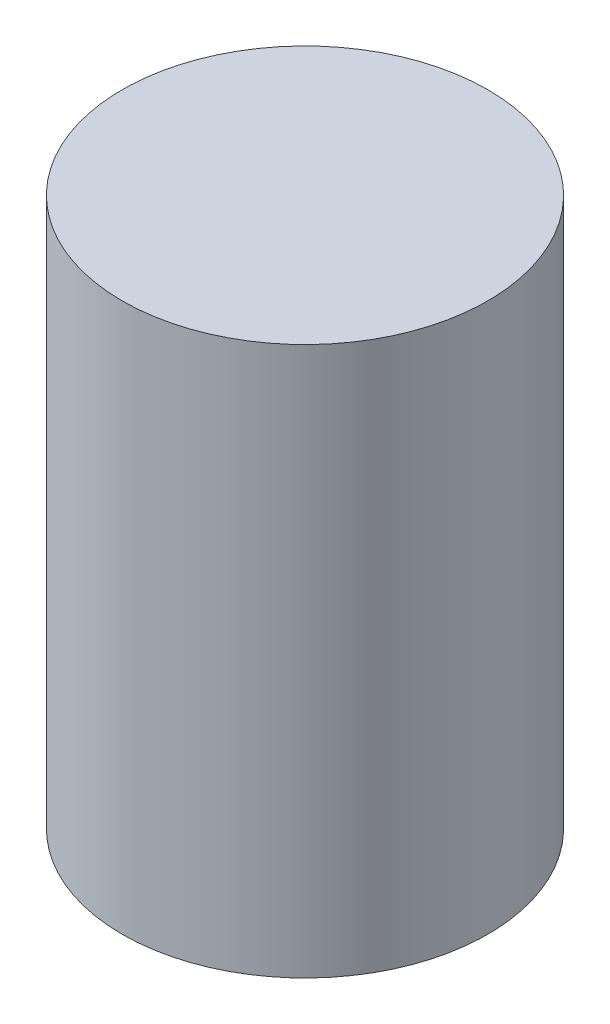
ISO-10303-21;
HEADER;
FILE_DESCRIPTION(('STEP AP214'),'2;1');
FILE_NAME('part.step','',(''),(''),'','','');
FILE_SCHEMA(('AUTOMOTIVE_DESIGN { 1 0 10303 214 1 1 1 1 }'));
ENDSEC;
DATA;
#1=APPLICATION_CONTEXT('core data for automotive mechanical design processes');
#2=APPLICATION_PROTOCOL_DEFINITION('international standard','automotive_design',2000,#1);
#3=PRODUCT_CONTEXT('',#1,'mechanical');
#4=PRODUCT('Part','Part','',(#3));
#5=PRODUCT_RELATED_PRODUCT_CATEGORY('part','',(#4));
#6=PRODUCT_DEFINITION_FORMATION('','',#4);
#7=PRODUCT_DEFINITION_CONTEXT('part definition',#1,'design');
#8=PRODUCT_DEFINITION('design','',#6,#7);
#9=PRODUCT_DEFINITION_SHAPE('','',#8);
#10=(LENGTH_UNIT() NAMED_UNIT(*) SI_UNIT(.MILLI.,.METRE.));
#11=(NAMED_UNIT(*) PLANE_ANGLE_UNIT() SI_UNIT($,.RADIAN.));
#12=(NAMED_UNIT(*) SI_UNIT($,.STERADIAN.) SOLID_ANGLE_UNIT());
#13=UNCERTAINTY_MEASURE_WITH_UNIT(LENGTH_MEASURE(1.E-05),#10,'distance_accuracy_value','');
#14=(GEOMETRIC_REPRESENTATION_CONTEXT(3) GLOBAL_UNCERTAINTY_ASSIGNED_CONTEXT((#13)) GLOBAL_UNIT_ASSIGNED_CONTEXT((#10,
#11,#12)) REPRESENTATION_CONTEXT('',''));
#15=CARTESIAN_POINT('',(0.,0.,0.));
#16=DIRECTION('',(0.,0.,1.));
#17=DIRECTION('',(1.,0.,0.));
#18=AXIS2_PLACEMENT_3D('',#15,#16,#17);
#19=CARTESIAN_POINT('',(0.,19.05,0.));
#20=DIRECTION('',(0.,-1.,0.));
#21=DIRECTION('',(0.,0.,-1.));
#22=AXIS2_PLACEMENT_3D('',#19,#20,#21);
#23=CYLINDRICAL_SURFACE('',#22,6.35);
#24=CARTESIAN_POINT('',(0.,5.08,-6.35));
#25=CARTESIAN_POINT('',(-0.0705826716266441,5.0799974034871,-6.34999869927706));
#26=CARTESIAN_POINT('',(-0.141198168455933,5.07409596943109,-6.34881109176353));
#27=CARTESIAN_POINT('',(-0.280433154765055,5.05066490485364,-6.34418804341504));
#28=CARTESIAN_POINT('',(-0.349051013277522,5.03312603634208,-6.34075081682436));
#29=CARTESIAN_POINT('',(-0.482257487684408,4.9869835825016,-6.33201234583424));
#30=CARTESIAN_POINT('',(-0.54684989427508,4.95839059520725,-6.32671288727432));
#31=CARTESIAN_POINT('',(-0.670316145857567,4.89098304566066,-6.31482605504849));
#32=CARTESIAN_POINT('',(-0.729190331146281,4.85216909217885,-6.30823875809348));
#33=CARTESIAN_POINT('',(-0.840350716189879,4.76486411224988,-6.29440149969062));
#34=CARTESIAN_POINT('',(-0.892548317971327,4.71626138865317,-6.28714446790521));
#35=CARTESIAN_POINT('',(-0.988106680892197,4.61099863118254,-6.27283709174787));
#36=CARTESIAN_POINT('',(-1.03146675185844,4.5543379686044,-6.26578676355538));
#37=CARTESIAN_POINT('',(-1.10849632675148,4.43393043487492,-6.25262201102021));
#38=CARTESIAN_POINT('',(-1.14207409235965,4.37012379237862,-6.24651668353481));
#39=CARTESIAN_POINT('',(-1.19799819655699,4.23763208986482,-6.23603360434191));
#40=CARTESIAN_POINT('',(-1.22034564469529,4.16894751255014,-6.23165568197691));
#41=CARTESIAN_POINT('',(-1.25288713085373,4.02960285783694,-6.225194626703));
#42=CARTESIAN_POINT('',(-1.26323661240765,3.95898046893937,-6.22308217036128));
#43=CARTESIAN_POINT('',(-1.27197120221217,3.81697252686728,-6.22130296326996));
#44=CARTESIAN_POINT('',(-1.27035753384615,3.74558705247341,-6.22163596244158));
#45=CARTESIAN_POINT('',(-1.25533730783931,3.60521657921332,-6.22468339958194));
#46=CARTESIAN_POINT('',(-1.24210894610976,3.53621161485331,-6.2273618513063));
#47=CARTESIAN_POINT('',(-1.20451611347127,3.40142058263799,-6.23474173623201));
#48=CARTESIAN_POINT('',(-1.18015111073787,3.33563466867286,-6.23944326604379));
#49=CARTESIAN_POINT('',(-1.12080647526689,3.20863561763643,-6.25037635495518));
#50=CARTESIAN_POINT('',(-1.08575621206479,3.14745639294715,-6.25661804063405));
#51=CARTESIAN_POINT('',(-1.0060858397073,3.03178102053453,-6.26992165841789));
#52=CARTESIAN_POINT('',(-0.961464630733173,2.97728564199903,-6.27698368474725));
#53=CARTESIAN_POINT('',(-0.862964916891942,2.87549665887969,-6.29128816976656));
#54=CARTESIAN_POINT('',(-0.808934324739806,2.8283502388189,-6.29853158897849));
#55=CARTESIAN_POINT('',(-0.693654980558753,2.74376661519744,-6.31226637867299));
#56=CARTESIAN_POINT('',(-0.632406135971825,2.70632953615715,-6.31875773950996));
#57=CARTESIAN_POINT('',(-0.50426542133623,2.64220006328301,-6.33027296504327));
#58=CARTESIAN_POINT('',(-0.437364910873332,2.61552449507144,-6.33529452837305));
#59=CARTESIAN_POINT('',(-0.299909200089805,2.57383219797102,-6.3432868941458));
#60=CARTESIAN_POINT('',(-0.229354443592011,2.55881405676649,-6.34625794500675));
#61=CARTESIAN_POINT('',(-0.0878578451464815,2.54107130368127,-6.34977993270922));
#62=CARTESIAN_POINT('',(-0.0169422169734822,2.53814526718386,-6.35037051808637));
#63=CARTESIAN_POINT('',(0.124364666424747,2.54412732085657,-6.3491751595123));
#64=CARTESIAN_POINT('',(0.194755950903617,2.55303474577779,-6.34738934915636));
#65=CARTESIAN_POINT('',(0.332366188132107,2.58226353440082,-6.34166666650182));
#66=CARTESIAN_POINT('',(0.399607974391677,2.60248154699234,-6.33774928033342));
#67=CARTESIAN_POINT('',(0.529747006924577,2.65364465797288,-6.32820111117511));
#68=CARTESIAN_POINT('',(0.592643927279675,2.68459056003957,-6.32257019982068));
#69=CARTESIAN_POINT('',(0.713157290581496,2.75676676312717,-6.31012087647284));
#70=CARTESIAN_POINT('',(0.770699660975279,2.79811833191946,-6.30328877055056));
#71=CARTESIAN_POINT('',(0.878100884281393,2.88976967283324,-6.28922713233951));
#72=CARTESIAN_POINT('',(0.927958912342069,2.94007040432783,-6.28199755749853));
#73=CARTESIAN_POINT('',(1.0193535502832,3.04910915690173,-6.26782215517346));
#74=CARTESIAN_POINT('',(1.06075188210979,3.1079639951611,-6.26088232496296));
#75=CARTESIAN_POINT('',(1.13307548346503,3.23191042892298,-6.24819923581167));
#76=CARTESIAN_POINT('',(1.16400117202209,3.29700177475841,-6.24245592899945));
#77=CARTESIAN_POINT('',(1.21431283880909,3.43124567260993,-6.23286460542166));
#78=CARTESIAN_POINT('',(1.23375864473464,3.5003750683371,-6.22900678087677));
#79=CARTESIAN_POINT('',(1.26073998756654,3.64100548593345,-6.22360244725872));
#80=CARTESIAN_POINT('',(1.26827707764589,3.71250619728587,-6.22205563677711));
#81=CARTESIAN_POINT('',(1.27116955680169,3.85446125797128,-6.22146520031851));
#82=CARTESIAN_POINT('',(1.26674345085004,3.9249110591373,-6.22237667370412));
#83=CARTESIAN_POINT('',(1.24631742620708,4.06404019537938,-6.22649978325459));
#84=CARTESIAN_POINT('',(1.23031760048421,4.1327195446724,-6.22971140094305));
#85=CARTESIAN_POINT('',(1.18729578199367,4.26621919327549,-6.23805285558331));
#86=CARTESIAN_POINT('',(1.16030058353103,4.33104843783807,-6.24317802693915));
#87=CARTESIAN_POINT('',(1.09607939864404,4.45529172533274,-6.25477178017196));
#88=CARTESIAN_POINT('',(1.0588525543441,4.51470531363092,-6.26124047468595));
#89=CARTESIAN_POINT('',(0.974478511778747,4.6275187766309,-6.27492979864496));
#90=CARTESIAN_POINT('',(0.92717351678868,4.68079933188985,-6.28216133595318));
#91=CARTESIAN_POINT('',(0.824311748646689,4.77873848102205,-6.29648323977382));
#92=CARTESIAN_POINT('',(0.768753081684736,4.82339509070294,-6.30357357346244));
#93=CARTESIAN_POINT('',(0.650262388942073,4.90325999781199,-6.31690167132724));
#94=CARTESIAN_POINT('',(0.58725928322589,4.93836452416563,-6.32312973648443));
#95=CARTESIAN_POINT('',(0.45614127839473,4.99743237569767,-6.3339360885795));
#96=CARTESIAN_POINT('',(0.38803105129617,5.02140574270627,-6.33851586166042));
#97=CARTESIAN_POINT('',(0.2664732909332,5.05288797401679,-6.34461993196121));
#98=CARTESIAN_POINT('',(0.213717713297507,5.06303685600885,-6.34662565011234));
#99=CARTESIAN_POINT('',(0.107314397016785,5.07659374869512,-6.34931615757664));
#100=CARTESIAN_POINT('',(0.0536666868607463,5.0800019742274,-6.35000098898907));
#101=CARTESIAN_POINT('',(0.,5.08,-6.35));
#102=B_SPLINE_CURVE_WITH_KNOTS('',3,(#24,#25,#26,#27,#28,#29,#30,#31,#32,#33,#34,#35,#36,#37,
#38,#39,#40,#41,#42,#43,#44,#45,#46,#47,#48,#49,#50,#51,#52,#53,#54,#55,#56,#57,#58,#59,#60,#61,
#62,#63,#64,#65,#66,#67,#68,#69,#70,#71,#72,#73,#74,#75,#76,#77,#78,#79,#80,#81,#82,#83,#84,#85,
#86,#87,#88,#89,#90,#91,#92,#93,#94,#95,#96,#97,#98,#99,#100,#101),.UNSPECIFIED.,.T.,.F.,(4,2,2,
2,2,2,2,2,2,2,2,2,2,2,2,2,2,2,2,2,2,2,2,2,2,2,2,2,2,2,2,2,2,2,2,2,2,2,4),(0.,0.211551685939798,
0.42327150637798,0.634788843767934,0.846293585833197,1.06036449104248,1.27445210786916,
1.49048717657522,1.70650089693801,1.91968355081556,2.13284440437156,2.34279093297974,
2.55274748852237,2.76412312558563,2.97552306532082,3.19072580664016,3.40593130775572,
3.62147199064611,3.83698655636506,4.04889634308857,4.26079421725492,4.47078676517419,
4.68079504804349,4.89337433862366,5.10597643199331,5.32181598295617,5.53764689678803,
5.75234283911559,5.96701077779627,6.17778447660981,6.38855648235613,6.5988179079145,
6.80909696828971,7.02294856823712,7.23684931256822,7.4529886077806,7.66893253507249,
7.82978844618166,7.99063923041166),.UNSPECIFIED.);
#103=CARTESIAN_POINT('',(0.,5.08,-6.35));
#104=VERTEX_POINT('',#103);
#105=EDGE_CURVE('E54',#104,#104,#102,.T.);
#106=ORIENTED_EDGE('',*,*,#105,.T.);
#107=EDGE_LOOP('',(#106));
#108=FACE_BOUND('',#107,.T.);
#109=CARTESIAN_POINT('',(0.,19.05,0.));
#110=DIRECTION('',(0.,1.,0.));
#111=DIRECTION('',(0.,0.,1.));
#112=AXIS2_PLACEMENT_3D('',#109,#110,#111);
#113=CIRCLE('',#112,6.35);
#114=CARTESIAN_POINT('',(0.,19.05,6.35));
#115=VERTEX_POINT('',#114);
#116=EDGE_CURVE('E10',#115,#115,#113,.T.);
#117=ORIENTED_EDGE('',*,*,#116,.F.);
#118=EDGE_LOOP('',(#117));
#119=FACE_BOUND('',#118,.T.);
#120=CARTESIAN_POINT('',(0.,0.,0.));
#121=DIRECTION('',(0.,1.,0.));
#122=DIRECTION('',(0.,0.,1.));
#123=AXIS2_PLACEMENT_3D('',#120,#121,#122);
#124=CIRCLE('',#123,6.35);
#125=CARTESIAN_POINT('',(0.,0.,6.35));
#126=VERTEX_POINT('',#125);
#127=EDGE_CURVE('E44',#126,#126,#124,.T.);
#128=ORIENTED_EDGE('',*,*,#127,.T.);
#129=EDGE_LOOP('',(#128));
#130=FACE_BOUND('',#129,.T.);
#131=ADVANCED_FACE('F31',(#108,#119,#130),#23,.T.);
#132=CARTESIAN_POINT('',(0.,19.05,0.));
#133=DIRECTION('',(0.,1.,0.));
#134=DIRECTION('',(0.,0.,1.));
#135=AXIS2_PLACEMENT_3D('',#132,#133,#134);
#136=PLANE('',#135);
#137=ORIENTED_EDGE('',*,*,#116,.T.);
#138=EDGE_LOOP('',(#137));
#139=FACE_BOUND('',#138,.T.);
#140=ADVANCED_FACE('F76',(#139),#136,.T.);
#141=CARTESIAN_POINT('',(0.,0.,0.));
#142=DIRECTION('',(0.,1.,0.));
#143=DIRECTION('',(0.,0.,1.));
#144=AXIS2_PLACEMENT_3D('',#141,#142,#143);
#145=PLANE('',#144);
#146=CARTESIAN_POINT('',(0.,0.,0.));
#147=DIRECTION('',(0.,-1.,0.));
#148=DIRECTION('',(0.,0.,-1.));
#149=AXIS2_PLACEMENT_3D('',#146,#147,#148);
#150=CIRCLE('',#149,3.175);
#151=CARTESIAN_POINT('',(0.,0.,-3.175));
#152=VERTEX_POINT('',#151);
#153=EDGE_CURVE('E51',#152,#152,#150,.T.);
#154=ORIENTED_EDGE('',*,*,#153,.F.);
#155=EDGE_LOOP('',(#154));
#156=FACE_BOUND('',#155,.T.);
#157=ORIENTED_EDGE('',*,*,#127,.F.);
#158=EDGE_LOOP('',(#157));
#159=FACE_BOUND('',#158,.T.);
#160=ADVANCED_FACE('F74',(#156,#159),#145,.F.);
#161=CARTESIAN_POINT('',(0.,15.875,0.));
#162=DIRECTION('',(0.,-1.,0.));
#163=DIRECTION('',(0.,0.,-1.));
#164=AXIS2_PLACEMENT_3D('',#161,#162,#163);
#165=CYLINDRICAL_SURFACE('',#164,3.175);
#166=CARTESIAN_POINT('',(0.,5.08,-3.175));
#167=CARTESIAN_POINT('',(0.068258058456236,5.07999374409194,-3.17499537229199));
#168=CARTESIAN_POINT('',(0.136634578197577,5.07446422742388,-3.17277301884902));
#169=CARTESIAN_POINT('',(0.271460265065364,5.05253770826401,-3.16409992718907));
#170=CARTESIAN_POINT('',(0.337903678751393,5.0361111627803,-3.15763769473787));
#171=CARTESIAN_POINT('',(0.466695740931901,4.99308369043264,-3.1411812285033));
#172=CARTESIAN_POINT('',(0.529057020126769,4.96651607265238,-3.13119856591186));
#173=CARTESIAN_POINT('',(0.648380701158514,4.90409282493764,-3.1086844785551));
#174=CARTESIAN_POINT('',(0.705344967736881,4.86824041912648,-3.09615393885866));
#175=CARTESIAN_POINT('',(0.815023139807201,4.7864804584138,-3.06915112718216));
#176=CARTESIAN_POINT('',(0.867449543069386,4.74020727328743,-3.05461858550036));
#177=CARTESIAN_POINT('',(0.964041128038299,4.63969099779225,-3.02552466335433));
#178=CARTESIAN_POINT('',(1.00820226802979,4.58544403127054,-3.01096327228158));
#179=CARTESIAN_POINT('',(1.08894535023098,4.46758817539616,-2.98273972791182));
#180=CARTESIAN_POINT('',(1.12510251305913,4.40367008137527,-2.96914643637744));
#181=CARTESIAN_POINT('',(1.18602424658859,4.27003438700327,-2.94534365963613));
#182=CARTESIAN_POINT('',(1.21079422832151,4.20031955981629,-2.93513256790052));
#183=CARTESIAN_POINT('',(1.24707575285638,4.06037266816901,-2.9198973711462));
#184=CARTESIAN_POINT('',(1.25913766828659,3.9903074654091,-2.91465901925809));
#185=CARTESIAN_POINT('',(1.27137983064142,3.84896677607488,-2.90934142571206));
#186=CARTESIAN_POINT('',(1.2715659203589,3.77769190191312,-2.90925964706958));
#187=CARTESIAN_POINT('',(1.26046824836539,3.64124451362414,-2.91408167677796));
#188=CARTESIAN_POINT('',(1.24998182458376,3.57599252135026,-2.91863891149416));
#189=CARTESIAN_POINT('',(1.21916626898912,3.44826618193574,-2.93164379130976));
#190=CARTESIAN_POINT('',(1.19883541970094,3.38579232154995,-2.94009211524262));
#191=CARTESIAN_POINT('',(1.14852115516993,3.26388867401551,-2.96011273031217));
#192=CARTESIAN_POINT('',(1.11834921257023,3.20454703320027,-2.971745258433));
#193=CARTESIAN_POINT('',(1.04934160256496,3.0915509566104,-2.9968070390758));
#194=CARTESIAN_POINT('',(1.01050268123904,3.03789866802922,-3.01023696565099));
#195=CARTESIAN_POINT('',(0.921734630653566,2.93343982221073,-3.03864477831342));
#196=CARTESIAN_POINT('',(0.871180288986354,2.88317385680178,-3.05366207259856));
#197=CARTESIAN_POINT('',(0.762199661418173,2.7916603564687,-3.08266988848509));
#198=CARTESIAN_POINT('',(0.703771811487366,2.75041461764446,-3.09666020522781));
#199=CARTESIAN_POINT('',(0.57916930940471,2.67740292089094,-3.12238822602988));
#200=CARTESIAN_POINT('',(0.512864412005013,2.64584035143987,-3.13407596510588));
#201=CARTESIAN_POINT('',(0.37530009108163,2.59450340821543,-3.15350415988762));
#202=CARTESIAN_POINT('',(0.304043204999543,2.57472304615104,-3.16124662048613));
#203=CARTESIAN_POINT('',(0.163128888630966,2.54860533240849,-3.17154648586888));
#204=CARTESIAN_POINT('',(0.0936264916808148,2.54154149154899,-3.17438370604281));
#205=CARTESIAN_POINT('',(-0.0456217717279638,2.53891218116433,-3.17543483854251));
#206=CARTESIAN_POINT('',(-0.115367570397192,2.54334373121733,-3.17364994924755));
#207=CARTESIAN_POINT('',(-0.249829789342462,2.56304526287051,-3.16584055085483));
#208=CARTESIAN_POINT('',(-0.314631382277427,2.57781931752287,-3.16001013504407));
#209=CARTESIAN_POINT('',(-0.440775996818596,2.61711167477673,-3.14489745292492));
#210=CARTESIAN_POINT('',(-0.502118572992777,2.64163122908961,-3.13561474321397));
#211=CARTESIAN_POINT('',(-0.621715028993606,2.70051843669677,-3.11414537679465));
#212=CARTESIAN_POINT('',(-0.679817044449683,2.7351643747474,-3.10187858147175));
#213=CARTESIAN_POINT('',(-0.789586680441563,2.81301210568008,-3.07577086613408));
#214=CARTESIAN_POINT('',(-0.841251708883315,2.85621732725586,-3.06192931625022));
#215=CARTESIAN_POINT('',(-0.940259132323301,2.95330245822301,-3.03304649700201));
#216=CARTESIAN_POINT('',(-0.987090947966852,3.00769879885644,-3.01798635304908));
#217=CARTESIAN_POINT('',(-1.07108701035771,3.12384445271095,-2.98920962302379));
#218=CARTESIAN_POINT('',(-1.10824966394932,3.18559497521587,-2.97549325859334));
#219=CARTESIAN_POINT('',(-1.17208776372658,3.31562817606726,-2.95093580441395));
#220=CARTESIAN_POINT('',(-1.19865812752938,3.38396833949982,-2.9401238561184));
#221=CARTESIAN_POINT('',(-1.23970809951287,3.52471586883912,-2.92305532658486));
#222=CARTESIAN_POINT('',(-1.25419663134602,3.59712019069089,-2.91679538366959));
#223=CARTESIAN_POINT('',(-1.26981941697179,3.73832621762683,-2.91002567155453));
#224=CARTESIAN_POINT('',(-1.27183964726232,3.80701222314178,-2.90913452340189));
#225=CARTESIAN_POINT('',(-1.26479500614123,3.94369598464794,-2.91220420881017));
#226=CARTESIAN_POINT('',(-1.25573154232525,4.01169382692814,-2.91616442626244));
#227=CARTESIAN_POINT('',(-1.22750031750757,4.14231594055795,-2.92815422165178));
#228=CARTESIAN_POINT('',(-1.20874630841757,4.20504637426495,-2.9360166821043));
#229=CARTESIAN_POINT('',(-1.16205345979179,4.32649542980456,-2.95480740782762));
#230=CARTESIAN_POINT('',(-1.13411208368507,4.38521293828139,-2.96573651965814));
#231=CARTESIAN_POINT('',(-1.06798920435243,4.50063210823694,-2.99020617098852));
#232=CARTESIAN_POINT('',(-1.02931298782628,4.55702585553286,-3.00386040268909));
#233=CARTESIAN_POINT('',(-0.9435414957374,4.66280075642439,-3.03189515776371));
#234=CARTESIAN_POINT('',(-0.896443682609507,4.71217978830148,-3.04627589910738));
#235=CARTESIAN_POINT('',(-0.791530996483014,4.8058088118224,-3.07526415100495));
#236=CARTESIAN_POINT('',(-0.733219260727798,4.84951868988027,-3.08982591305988));
#237=CARTESIAN_POINT('',(-0.60953670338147,4.92654402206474,-3.1165825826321));
#238=CARTESIAN_POINT('',(-0.544162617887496,4.95985464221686,-3.12877638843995));
#239=CARTESIAN_POINT('',(-0.409408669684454,5.01435510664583,-3.14921718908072));
#240=CARTESIAN_POINT('',(-0.340126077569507,5.03575912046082,-3.15753345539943));
#241=CARTESIAN_POINT('',(-0.198676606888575,5.06643584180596,-3.16956634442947));
#242=CARTESIAN_POINT('',(-0.126519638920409,5.07574704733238,-3.1732975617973));
#243=CARTESIAN_POINT('',(-0.0361393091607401,5.0796160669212,-3.17484696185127));
#244=CARTESIAN_POINT('',(-0.0180738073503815,5.08000165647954,-3.17500122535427));
#245=CARTESIAN_POINT('',(0.,5.08,-3.175));
#246=B_SPLINE_CURVE_WITH_KNOTS('',3,(#166,#167,#168,#169,#170,#171,#172,#173,#174,#175,#176,
#177,#178,#179,#180,#181,#182,#183,#184,#185,#186,#187,#188,#189,#190,#191,#192,#193,#194,#195,
#196,#197,#198,#199,#200,#201,#202,#203,#204,#205,#206,#207,#208,#209,#210,#211,#212,#213,#214,
#215,#216,#217,#218,#219,#220,#221,#222,#223,#224,#225,#226,#227,#228,#229,#230,#231,#232,#233,
#234,#235,#236,#237,#238,#239,#240,#241,#242,#243,#244,#245),.UNSPECIFIED.,.T.,.F.,(4,2,2,2,2,2,
2,2,2,2,2,2,2,2,2,2,2,2,2,2,2,2,2,2,2,2,2,2,2,2,2,2,2,2,2,2,2,2,2,4),(0.,0.2047258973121,
0.410009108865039,0.614623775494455,0.819167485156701,1.03249337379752,1.24592330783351,
1.46885189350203,1.691674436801,1.90439106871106,2.1170030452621,2.31481838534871,
2.5126682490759,2.71455595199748,2.91651957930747,3.13409551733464,3.35171473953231,
3.57363339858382,3.79543917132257,4.00411432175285,4.21273537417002,4.41198289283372,
4.61125601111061,4.81662431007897,5.02207504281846,5.24108981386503,5.4601406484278,
5.68131353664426,5.90232292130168,6.10742792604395,6.31250688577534,6.50947592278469,
6.70649938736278,6.91480372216,7.1231709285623,7.34504768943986,7.56702743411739,
7.78487331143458,8.00202395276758,8.05623259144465),.UNSPECIFIED.);
#247=CARTESIAN_POINT('',(0.,5.08,-3.175));
#248=VERTEX_POINT('',#247);
#249=EDGE_CURVE('E35',#248,#248,#246,.T.);
#250=ORIENTED_EDGE('',*,*,#249,.T.);
#251=EDGE_LOOP('',(#250));
#252=FACE_BOUND('',#251,.T.);
#253=CARTESIAN_POINT('',(0.,15.875,0.));
#254=DIRECTION('',(0.,-1.,0.));
#255=DIRECTION('',(0.,0.,-1.));
#256=AXIS2_PLACEMENT_3D('',#253,#254,#255);
#257=CIRCLE('',#256,3.175);
#258=CARTESIAN_POINT('',(0.,15.875,-3.175));
#259=VERTEX_POINT('',#258);
#260=EDGE_CURVE('E49',#259,#259,#257,.T.);
#261=ORIENTED_EDGE('',*,*,#260,.F.);
#262=EDGE_LOOP('',(#261));
#263=FACE_BOUND('',#262,.T.);
#264=ORIENTED_EDGE('',*,*,#153,.T.);
#265=EDGE_LOOP('',(#264));
#266=FACE_BOUND('',#265,.T.);
#267=ADVANCED_FACE('F69',(#252,#263,#266),#165,.F.);
#268=CARTESIAN_POINT('',(0.,15.875,0.));
#269=DIRECTION('',(0.,-1.,0.));
#270=DIRECTION('',(0.,0.,-1.));
#271=AXIS2_PLACEMENT_3D('',#268,#269,#270);
#272=PLANE('',#271);
#273=ORIENTED_EDGE('',*,*,#260,.T.);
#274=EDGE_LOOP('',(#273));
#275=FACE_BOUND('',#274,.T.);
#276=ADVANCED_FACE('F65',(#275),#272,.T.);
#277=CARTESIAN_POINT('',(0.,3.81,-6.35));
#278=DIRECTION('',(0.,0.,1.));
#279=DIRECTION('',(1.,0.,0.));
#280=AXIS2_PLACEMENT_3D('',#277,#278,#279);
#281=CYLINDRICAL_SURFACE('',#280,1.27);
#282=ORIENTED_EDGE('',*,*,#249,.F.);
#283=EDGE_LOOP('',(#282));
#284=FACE_BOUND('',#283,.T.);
#285=ORIENTED_EDGE('',*,*,#105,.F.);
#286=EDGE_LOOP('',(#285));
#287=FACE_BOUND('',#286,.T.);
#288=ADVANCED_FACE('F61',(#284,#287),#281,.F.);
#289=CLOSED_SHELL('',(#131,#140,#160,#267,#276,#288));
#290=MANIFOLD_SOLID_BREP('B2',#289);
#291=ADVANCED_BREP_SHAPE_REPRESENTATION('',(#18,#290),#14);
#292=SHAPE_DEFINITION_REPRESENTATION(#9,#291);
ENDSEC;
END-ISO-10303-21;
